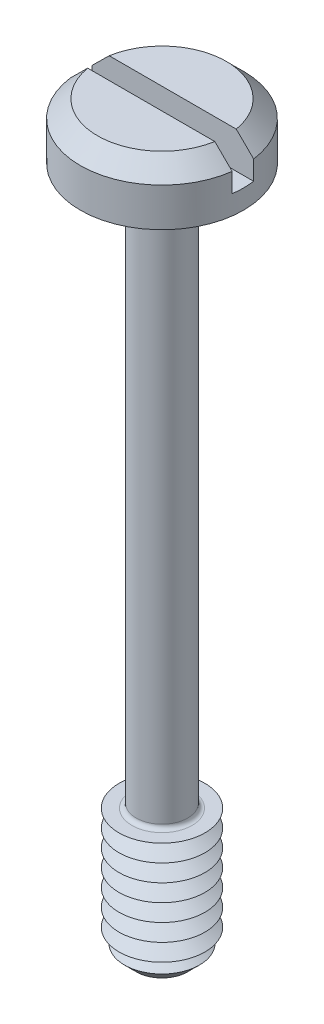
from build123d import *

# Parameters (mm, degrees)
SKETCH1_R           = 1.9
BOSS_EXTRUDE1_DEPTH = 1.3
SKETCH2_R           = 0.6
BOSS_EXTRUDE2_DEPTH = 16
SKETCH3_R           = 1
BOSS_EXTRUDE3_DEPTH = 3
CHAMFER1_SIZE       = 0.4
LPATTERN1_COUNT     = 7
LPATTERN1_PITCH     = 0.4
FILLET1_R           = 0.1
CHAMFER2_SIZE       = 0.4
SKETCH6_W           = 3.8
SKETCH6_H           = 0.5
CUT_EXTRUDE1_DEPTH  = 0.85


with BuildPart() as part:
    # Sketch1 → Boss-Extrude1 (new body)
    with BuildSketch(Plane(origin=(0, 0, 0), x_dir=(1, 0, 0), z_dir=(0, 1, 0))):
        with Locations(Location((0, 0, 0), (0, 0, 270))):
            Circle(SKETCH1_R)
    extrude(amount=BOSS_EXTRUDE1_DEPTH)

    # Sketch2 → Boss-Extrude2 (add)
    with BuildSketch(Plane.XZ):
        with Locations(Location((0, 0, 0), (0, 0, 270))):
            Circle(SKETCH2_R)
    extrude(amount=BOSS_EXTRUDE2_DEPTH)

    # Sketch3 → Boss-Extrude3 (add)
    with BuildSketch(Plane.XZ.offset(16)):
        with Locations(Location((0, 0, 0), (0, 0, 270))):
            Circle(SKETCH3_R)
    extrude(amount=-BOSS_EXTRUDE3_DEPTH)

    # Chamfer1
    chamfer1_edges = [part.edges().sort_by_distance(p)[0] for p in [
        (0, -16, 1),
    ]]
    chamfer(chamfer1_edges, length=CHAMFER1_SIZE)

    # Sketch5 → Cut-Revolve1 (revolve, cut)
    with BuildSketch(Plane(origin=(0, 0, 0), x_dir=(0, 0, -1), z_dir=(1, 0, 0))):
        Polygon((-1, -13), (-0.653589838, -13.2), (-1, -13.4), align=None)
    cut_revolve1 = revolve(axis=Axis((0, -6.58711856, 0), (0, -1, 0)), mode=Mode.SUBTRACT)

    # LPattern1: Cut-Revolve1 ×7
    with Locations(*[(0, -i * LPATTERN1_PITCH, 0) for i in range(1, LPATTERN1_COUNT)]):
        add(cut_revolve1, mode=Mode.SUBTRACT)

    # Fillet1
    fillet1_edges = [part.edges().sort_by_distance(p)[0] for p in [
        (0, 0, 0.6),
        (0, -13, 0.6),
    ]]
    fillet(fillet1_edges, radius=FILLET1_R)

    # Chamfer2
    chamfer2_edges = [part.edges().sort_by_distance(p)[0] for p in [
        (0, 1.3, -1.9),
    ]]
    chamfer(chamfer2_edges, length=CHAMFER2_SIZE)

    # Sketch6 → Cut-Extrude1 (cut)
    with BuildSketch(Plane(origin=(0, 1.3, 0), x_dir=(1, 0, 0), z_dir=(0, 1, 0))):
        Rectangle(SKETCH6_W, SKETCH6_H)
    extrude(amount=-CUT_EXTRUDE1_DEPTH, mode=Mode.SUBTRACT)


solid = part.part
